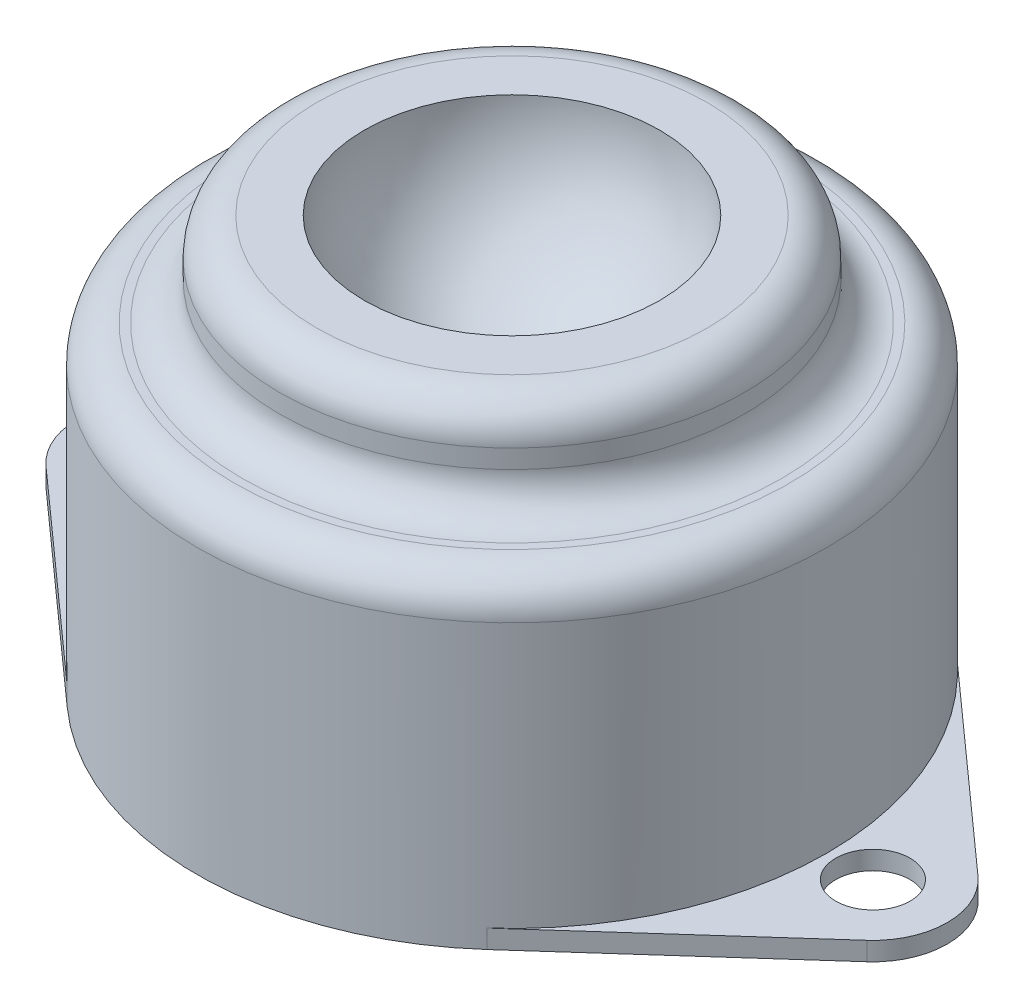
ISO-10303-21;
HEADER;
FILE_DESCRIPTION(('STEP AP214'),'2;1');
FILE_NAME('part.step','',(''),(''),'','','');
FILE_SCHEMA(('AUTOMOTIVE_DESIGN { 1 0 10303 214 1 1 1 1 }'));
ENDSEC;
DATA;
#1=APPLICATION_CONTEXT('core data for automotive mechanical design processes');
#2=APPLICATION_PROTOCOL_DEFINITION('international standard','automotive_design',2000,#1);
#3=PRODUCT_CONTEXT('',#1,'mechanical');
#4=PRODUCT('Part','Part','',(#3));
#5=PRODUCT_RELATED_PRODUCT_CATEGORY('part','',(#4));
#6=PRODUCT_DEFINITION_FORMATION('','',#4);
#7=PRODUCT_DEFINITION_CONTEXT('part definition',#1,'design');
#8=PRODUCT_DEFINITION('design','',#6,#7);
#9=PRODUCT_DEFINITION_SHAPE('','',#8);
#10=(LENGTH_UNIT() NAMED_UNIT(*) SI_UNIT(.MILLI.,.METRE.));
#11=(NAMED_UNIT(*) PLANE_ANGLE_UNIT() SI_UNIT($,.RADIAN.));
#12=(NAMED_UNIT(*) SI_UNIT($,.STERADIAN.) SOLID_ANGLE_UNIT());
#13=UNCERTAINTY_MEASURE_WITH_UNIT(LENGTH_MEASURE(1.E-05),#10,'distance_accuracy_value','');
#14=(GEOMETRIC_REPRESENTATION_CONTEXT(3) GLOBAL_UNCERTAINTY_ASSIGNED_CONTEXT((#13)) GLOBAL_UNIT_ASSIGNED_CONTEXT((#10,
#11,#12)) REPRESENTATION_CONTEXT('',''));
#15=CARTESIAN_POINT('',(0.,0.,0.));
#16=DIRECTION('',(0.,0.,1.));
#17=DIRECTION('',(1.,0.,0.));
#18=AXIS2_PLACEMENT_3D('',#15,#16,#17);
#19=CARTESIAN_POINT('',(0.,1.,0.));
#20=DIRECTION('',(0.,-1.,0.));
#21=DIRECTION('',(0.,0.,-1.));
#22=AXIS2_PLACEMENT_3D('',#19,#20,#21);
#23=CYLINDRICAL_SURFACE('',#22,16.9333333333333);
#24=CARTESIAN_POINT('',(0.,15.225,0.));
#25=DIRECTION('',(0.,1.,0.));
#26=DIRECTION('',(0.,0.,1.));
#27=AXIS2_PLACEMENT_3D('',#24,#25,#26);
#28=CIRCLE('',#27,16.9333333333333);
#29=CARTESIAN_POINT('',(0.,15.225,16.9333333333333));
#30=VERTEX_POINT('',#29);
#31=EDGE_CURVE('E189',#30,#30,#28,.F.);
#32=ORIENTED_EDGE('',*,*,#31,.T.);
#33=EDGE_LOOP('',(#32));
#34=FACE_BOUND('',#33,.T.);
#35=CARTESIAN_POINT('',(0.,0.,0.));
#36=DIRECTION('',(0.,1.,0.));
#37=DIRECTION('',(0.,0.,1.));
#38=AXIS2_PLACEMENT_3D('',#35,#36,#37);
#39=CIRCLE('',#38,16.9333333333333);
#40=CARTESIAN_POINT('',(11.2888888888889,0.,-12.6213614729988));
#41=VERTEX_POINT('',#40);
#42=CARTESIAN_POINT('',(-11.2888888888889,0.,-12.6213614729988));
#43=VERTEX_POINT('',#42);
#44=EDGE_CURVE('E95',#41,#43,#39,.T.);
#45=ORIENTED_EDGE('',*,*,#44,.T.);
#46=DIRECTION('',(0.,-1.,0.));
#47=VECTOR('',#46,1.);
#48=CARTESIAN_POINT('',(-11.2888888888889,1.,-12.6213614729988));
#49=LINE('',#48,#47);
#50=CARTESIAN_POINT('',(-11.2888888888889,1.,-12.6213614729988));
#51=VERTEX_POINT('',#50);
#52=EDGE_CURVE('E142',#51,#43,#49,.T.);
#53=ORIENTED_EDGE('',*,*,#52,.F.);
#54=CARTESIAN_POINT('',(0.,1.,0.));
#55=DIRECTION('',(0.,1.,0.));
#56=DIRECTION('',(0.,0.,1.));
#57=AXIS2_PLACEMENT_3D('',#54,#55,#56);
#58=CIRCLE('',#57,16.9333333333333);
#59=CARTESIAN_POINT('',(-11.2888888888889,1.,12.6213614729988));
#60=VERTEX_POINT('',#59);
#61=EDGE_CURVE('E62',#51,#60,#58,.T.);
#62=ORIENTED_EDGE('',*,*,#61,.T.);
#63=DIRECTION('',(0.,-1.,0.));
#64=VECTOR('',#63,1.);
#65=CARTESIAN_POINT('',(-11.2888888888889,1.,12.6213614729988));
#66=LINE('',#65,#64);
#67=CARTESIAN_POINT('',(-11.2888888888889,0.,12.6213614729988));
#68=VERTEX_POINT('',#67);
#69=EDGE_CURVE('E175',#60,#68,#66,.T.);
#70=ORIENTED_EDGE('',*,*,#69,.T.);
#71=CARTESIAN_POINT('',(11.2888888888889,0.,12.6213614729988));
#72=VERTEX_POINT('',#71);
#73=EDGE_CURVE('E157',#68,#72,#39,.T.);
#74=ORIENTED_EDGE('',*,*,#73,.T.);
#75=DIRECTION('',(0.,-1.,0.));
#76=VECTOR('',#75,1.);
#77=CARTESIAN_POINT('',(11.2888888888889,1.,12.6213614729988));
#78=LINE('',#77,#76);
#79=CARTESIAN_POINT('',(11.2888888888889,1.,12.6213614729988));
#80=VERTEX_POINT('',#79);
#81=EDGE_CURVE('E173',#80,#72,#78,.T.);
#82=ORIENTED_EDGE('',*,*,#81,.F.);
#83=CARTESIAN_POINT('',(11.2888888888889,1.,-12.6213614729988));
#84=VERTEX_POINT('',#83);
#85=EDGE_CURVE('E150',#80,#84,#58,.T.);
#86=ORIENTED_EDGE('',*,*,#85,.T.);
#87=DIRECTION('',(0.,-1.,0.));
#88=VECTOR('',#87,1.);
#89=CARTESIAN_POINT('',(11.2888888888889,1.,-12.6213614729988));
#90=LINE('',#89,#88);
#91=EDGE_CURVE('E92',#84,#41,#90,.T.);
#92=ORIENTED_EDGE('',*,*,#91,.T.);
#93=EDGE_LOOP('',(#45,#53,#62,#70,#74,#82,#86,#92));
#94=FACE_BOUND('',#93,.T.);
#95=ADVANCED_FACE('F45',(#34,#94),#23,.T.);
#96=CARTESIAN_POINT('',(0.,1.,0.));
#97=DIRECTION('',(0.,1.,0.));
#98=DIRECTION('',(0.,0.,1.));
#99=AXIS2_PLACEMENT_3D('',#96,#97,#98);
#100=PLANE('',#99);
#101=ORIENTED_EDGE('',*,*,#85,.F.);
#102=DIRECTION('',(-0.74535599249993,0.,0.666666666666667));
#103=VECTOR('',#102,1.);
#104=CARTESIAN_POINT('',(11.2888888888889,1.,12.6213614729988));
#105=LINE('',#104,#103);
#106=CARTESIAN_POINT('',(22.0666666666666,1.,2.98142396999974));
#107=VERTEX_POINT('',#106);
#108=EDGE_CURVE('E136',#107,#80,#105,.T.);
#109=ORIENTED_EDGE('',*,*,#108,.F.);
#110=CARTESIAN_POINT('',(19.4,1.,0.));
#111=DIRECTION('',(0.,1.,0.));
#112=DIRECTION('',(0.,0.,1.));
#113=AXIS2_PLACEMENT_3D('',#110,#111,#112);
#114=CIRCLE('',#113,4.);
#115=CARTESIAN_POINT('',(22.0666666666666,1.,-2.98142396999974));
#116=VERTEX_POINT('',#115);
#117=EDGE_CURVE('E119',#116,#107,#114,.F.);
#118=ORIENTED_EDGE('',*,*,#117,.F.);
#119=DIRECTION('',(0.74535599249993,0.,0.666666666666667));
#120=VECTOR('',#119,1.);
#121=CARTESIAN_POINT('',(11.2888888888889,1.,-12.6213614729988));
#122=LINE('',#121,#120);
#123=EDGE_CURVE('E134',#84,#116,#122,.T.);
#124=ORIENTED_EDGE('',*,*,#123,.F.);
#125=EDGE_LOOP('',(#101,#109,#118,#124));
#126=FACE_BOUND('',#125,.T.);
#127=CARTESIAN_POINT('',(19.4,1.,0.));
#128=DIRECTION('',(0.,1.,0.));
#129=DIRECTION('',(0.,0.,1.));
#130=AXIS2_PLACEMENT_3D('',#127,#128,#129);
#131=CIRCLE('',#130,2.);
#132=CARTESIAN_POINT('',(19.4,1.,2.));
#133=VERTEX_POINT('',#132);
#134=EDGE_CURVE('E139',#133,#133,#131,.T.);
#135=ORIENTED_EDGE('',*,*,#134,.F.);
#136=EDGE_LOOP('',(#135));
#137=FACE_BOUND('',#136,.T.);
#138=ADVANCED_FACE('F132',(#126,#137),#100,.T.);
#139=CARTESIAN_POINT('',(-11.2888888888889,1.,-12.6213614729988));
#140=DIRECTION('',(0.666666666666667,0.,0.74535599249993));
#141=DIRECTION('',(0.74535599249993,0.,-0.666666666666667));
#142=AXIS2_PLACEMENT_3D('',#139,#140,#141);
#143=PLANE('',#142);
#144=DIRECTION('',(-0.74535599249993,0.,0.666666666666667));
#145=VECTOR('',#144,1.);
#146=CARTESIAN_POINT('',(-11.2888888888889,0.,-12.6213614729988));
#147=LINE('',#146,#145);
#148=CARTESIAN_POINT('',(-22.0666666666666,0.,-2.98142396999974));
#149=VERTEX_POINT('',#148);
#150=EDGE_CURVE('E149',#43,#149,#147,.T.);
#151=ORIENTED_EDGE('',*,*,#150,.T.);
#152=DIRECTION('',(0.,-1.,0.));
#153=VECTOR('',#152,1.);
#154=CARTESIAN_POINT('',(-22.0666666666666,1.,-2.98142396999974));
#155=LINE('',#154,#153);
#156=CARTESIAN_POINT('',(-22.0666666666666,1.,-2.98142396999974));
#157=VERTEX_POINT('',#156);
#158=EDGE_CURVE('E181',#157,#149,#155,.T.);
#159=ORIENTED_EDGE('',*,*,#158,.F.);
#160=DIRECTION('',(-0.74535599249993,0.,0.666666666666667));
#161=VECTOR('',#160,1.);
#162=CARTESIAN_POINT('',(-11.2888888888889,1.,-12.6213614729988));
#163=LINE('',#162,#161);
#164=EDGE_CURVE('E269',#51,#157,#163,.T.);
#165=ORIENTED_EDGE('',*,*,#164,.F.);
#166=ORIENTED_EDGE('',*,*,#52,.T.);
#167=EDGE_LOOP('',(#151,#159,#165,#166));
#168=FACE_BOUND('',#167,.T.);
#169=ADVANCED_FACE('F221',(#168),#143,.F.);
#170=CARTESIAN_POINT('',(-19.4,1.,0.));
#171=DIRECTION('',(0.,-1.,0.));
#172=DIRECTION('',(0.,0.,-1.));
#173=AXIS2_PLACEMENT_3D('',#170,#171,#172);
#174=CYLINDRICAL_SURFACE('',#173,4.);
#175=CARTESIAN_POINT('',(-19.4,0.,0.));
#176=DIRECTION('',(0.,1.,0.));
#177=DIRECTION('',(0.,0.,1.));
#178=AXIS2_PLACEMENT_3D('',#175,#176,#177);
#179=CIRCLE('',#178,4.);
#180=CARTESIAN_POINT('',(-22.0666666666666,0.,2.98142396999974));
#181=VERTEX_POINT('',#180);
#182=EDGE_CURVE('E153',#149,#181,#179,.T.);
#183=ORIENTED_EDGE('',*,*,#182,.T.);
#184=DIRECTION('',(0.,-1.,0.));
#185=VECTOR('',#184,1.);
#186=CARTESIAN_POINT('',(-22.0666666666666,1.,2.98142396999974));
#187=LINE('',#186,#185);
#188=CARTESIAN_POINT('',(-22.0666666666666,1.,2.98142396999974));
#189=VERTEX_POINT('',#188);
#190=EDGE_CURVE('E178',#189,#181,#187,.T.);
#191=ORIENTED_EDGE('',*,*,#190,.F.);
#192=CARTESIAN_POINT('',(-19.4,1.,0.));
#193=DIRECTION('',(0.,1.,0.));
#194=DIRECTION('',(0.,0.,1.));
#195=AXIS2_PLACEMENT_3D('',#192,#193,#194);
#196=CIRCLE('',#195,4.);
#197=EDGE_CURVE('E104',#157,#189,#196,.T.);
#198=ORIENTED_EDGE('',*,*,#197,.F.);
#199=ORIENTED_EDGE('',*,*,#158,.T.);
#200=EDGE_LOOP('',(#183,#191,#198,#199));
#201=FACE_BOUND('',#200,.T.);
#202=ADVANCED_FACE('F240',(#201),#174,.T.);
#203=CARTESIAN_POINT('',(-11.2888888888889,1.,12.6213614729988));
#204=DIRECTION('',(0.666666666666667,0.,-0.74535599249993));
#205=DIRECTION('',(-0.74535599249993,0.,-0.666666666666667));
#206=AXIS2_PLACEMENT_3D('',#203,#204,#205);
#207=PLANE('',#206);
#208=DIRECTION('',(0.74535599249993,0.,0.666666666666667));
#209=VECTOR('',#208,1.);
#210=CARTESIAN_POINT('',(-11.2888888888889,0.,12.6213614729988));
#211=LINE('',#210,#209);
#212=EDGE_CURVE('E155',#181,#68,#211,.T.);
#213=ORIENTED_EDGE('',*,*,#212,.T.);
#214=ORIENTED_EDGE('',*,*,#69,.F.);
#215=DIRECTION('',(0.74535599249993,0.,0.666666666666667));
#216=VECTOR('',#215,1.);
#217=CARTESIAN_POINT('',(-11.2888888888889,1.,12.6213614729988));
#218=LINE('',#217,#216);
#219=EDGE_CURVE('E298',#189,#60,#218,.T.);
#220=ORIENTED_EDGE('',*,*,#219,.F.);
#221=ORIENTED_EDGE('',*,*,#190,.T.);
#222=EDGE_LOOP('',(#213,#214,#220,#221));
#223=FACE_BOUND('',#222,.T.);
#224=ADVANCED_FACE('F236',(#223),#207,.F.);
#225=CARTESIAN_POINT('',(11.2888888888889,1.,12.6213614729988));
#226=DIRECTION('',(0.666666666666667,0.,0.74535599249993));
#227=DIRECTION('',(0.74535599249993,0.,-0.666666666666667));
#228=AXIS2_PLACEMENT_3D('',#225,#226,#227);
#229=PLANE('',#228);
#230=DIRECTION('',(-0.74535599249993,0.,0.666666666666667));
#231=VECTOR('',#230,1.);
#232=CARTESIAN_POINT('',(11.2888888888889,0.,12.6213614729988));
#233=LINE('',#232,#231);
#234=CARTESIAN_POINT('',(22.0666666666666,0.,2.98142396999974));
#235=VERTEX_POINT('',#234);
#236=EDGE_CURVE('E160',#235,#72,#233,.T.);
#237=ORIENTED_EDGE('',*,*,#236,.F.);
#238=DIRECTION('',(0.,-1.,0.));
#239=VECTOR('',#238,1.);
#240=CARTESIAN_POINT('',(22.0666666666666,1.,2.98142396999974));
#241=LINE('',#240,#239);
#242=EDGE_CURVE('E126',#107,#235,#241,.T.);
#243=ORIENTED_EDGE('',*,*,#242,.F.);
#244=ORIENTED_EDGE('',*,*,#108,.T.);
#245=ORIENTED_EDGE('',*,*,#81,.T.);
#246=EDGE_LOOP('',(#237,#243,#244,#245));
#247=FACE_BOUND('',#246,.T.);
#248=ADVANCED_FACE('F233',(#247),#229,.T.);
#249=CARTESIAN_POINT('',(19.4,1.,0.));
#250=DIRECTION('',(0.,-1.,0.));
#251=DIRECTION('',(0.,0.,-1.));
#252=AXIS2_PLACEMENT_3D('',#249,#250,#251);
#253=CYLINDRICAL_SURFACE('',#252,4.);
#254=CARTESIAN_POINT('',(19.4,0.,0.));
#255=DIRECTION('',(0.,1.,0.));
#256=DIRECTION('',(0.,0.,1.));
#257=AXIS2_PLACEMENT_3D('',#254,#255,#256);
#258=CIRCLE('',#257,4.);
#259=CARTESIAN_POINT('',(22.0666666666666,0.,-2.98142396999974));
#260=VERTEX_POINT('',#259);
#261=EDGE_CURVE('E121',#260,#235,#258,.F.);
#262=ORIENTED_EDGE('',*,*,#261,.F.);
#263=DIRECTION('',(0.,-1.,0.));
#264=VECTOR('',#263,1.);
#265=CARTESIAN_POINT('',(22.0666666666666,1.,-2.98142396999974));
#266=LINE('',#265,#264);
#267=EDGE_CURVE('E116',#116,#260,#266,.T.);
#268=ORIENTED_EDGE('',*,*,#267,.F.);
#269=ORIENTED_EDGE('',*,*,#117,.T.);
#270=ORIENTED_EDGE('',*,*,#242,.T.);
#271=EDGE_LOOP('',(#262,#268,#269,#270));
#272=FACE_BOUND('',#271,.T.);
#273=ADVANCED_FACE('F118',(#272),#253,.T.);
#274=CARTESIAN_POINT('',(11.2888888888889,1.,-12.6213614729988));
#275=DIRECTION('',(0.666666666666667,0.,-0.74535599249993));
#276=DIRECTION('',(-0.74535599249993,0.,-0.666666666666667));
#277=AXIS2_PLACEMENT_3D('',#274,#275,#276);
#278=PLANE('',#277);
#279=DIRECTION('',(0.74535599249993,0.,0.666666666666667));
#280=VECTOR('',#279,1.);
#281=CARTESIAN_POINT('',(11.2888888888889,0.,-12.6213614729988));
#282=LINE('',#281,#280);
#283=EDGE_CURVE('E164',#41,#260,#282,.T.);
#284=ORIENTED_EDGE('',*,*,#283,.F.);
#285=ORIENTED_EDGE('',*,*,#91,.F.);
#286=ORIENTED_EDGE('',*,*,#123,.T.);
#287=ORIENTED_EDGE('',*,*,#267,.T.);
#288=EDGE_LOOP('',(#284,#285,#286,#287));
#289=FACE_BOUND('',#288,.T.);
#290=ADVANCED_FACE('F138',(#289),#278,.T.);
#291=CARTESIAN_POINT('',(-19.4,1.,0.));
#292=DIRECTION('',(0.,-1.,0.));
#293=DIRECTION('',(0.,0.,-1.));
#294=AXIS2_PLACEMENT_3D('',#291,#292,#293);
#295=CYLINDRICAL_SURFACE('',#294,2.);
#296=CARTESIAN_POINT('',(-19.4,1.,0.));
#297=DIRECTION('',(0.,1.,0.));
#298=DIRECTION('',(0.,0.,1.));
#299=AXIS2_PLACEMENT_3D('',#296,#297,#298);
#300=CIRCLE('',#299,2.);
#301=CARTESIAN_POINT('',(-19.4,1.,2.));
#302=VERTEX_POINT('',#301);
#303=EDGE_CURVE('E169',#302,#302,#300,.T.);
#304=ORIENTED_EDGE('',*,*,#303,.T.);
#305=EDGE_LOOP('',(#304));
#306=FACE_BOUND('',#305,.T.);
#307=CARTESIAN_POINT('',(-19.4,0.,0.));
#308=DIRECTION('',(0.,1.,0.));
#309=DIRECTION('',(0.,0.,1.));
#310=AXIS2_PLACEMENT_3D('',#307,#308,#309);
#311=CIRCLE('',#310,2.);
#312=CARTESIAN_POINT('',(-19.4,0.,2.));
#313=VERTEX_POINT('',#312);
#314=EDGE_CURVE('E146',#313,#313,#311,.T.);
#315=ORIENTED_EDGE('',*,*,#314,.F.);
#316=EDGE_LOOP('',(#315));
#317=FACE_BOUND('',#316,.T.);
#318=ADVANCED_FACE('F230',(#306,#317),#295,.F.);
#319=CARTESIAN_POINT('',(19.4,1.,0.));
#320=DIRECTION('',(0.,-1.,0.));
#321=DIRECTION('',(0.,0.,-1.));
#322=AXIS2_PLACEMENT_3D('',#319,#320,#321);
#323=CYLINDRICAL_SURFACE('',#322,2.);
#324=ORIENTED_EDGE('',*,*,#134,.T.);
#325=EDGE_LOOP('',(#324));
#326=FACE_BOUND('',#325,.T.);
#327=CARTESIAN_POINT('',(19.4,0.,0.));
#328=DIRECTION('',(0.,1.,0.));
#329=DIRECTION('',(0.,0.,1.));
#330=AXIS2_PLACEMENT_3D('',#327,#328,#329);
#331=CIRCLE('',#330,2.);
#332=CARTESIAN_POINT('',(19.4,0.,2.));
#333=VERTEX_POINT('',#332);
#334=EDGE_CURVE('E166',#333,#333,#331,.T.);
#335=ORIENTED_EDGE('',*,*,#334,.F.);
#336=EDGE_LOOP('',(#335));
#337=FACE_BOUND('',#336,.T.);
#338=ADVANCED_FACE('F226',(#326,#337),#323,.F.);
#339=ORIENTED_EDGE('',*,*,#61,.F.);
#340=ORIENTED_EDGE('',*,*,#164,.T.);
#341=ORIENTED_EDGE('',*,*,#197,.T.);
#342=ORIENTED_EDGE('',*,*,#219,.T.);
#343=EDGE_LOOP('',(#339,#340,#341,#342));
#344=FACE_BOUND('',#343,.T.);
#345=ORIENTED_EDGE('',*,*,#303,.F.);
#346=EDGE_LOOP('',(#345));
#347=FACE_BOUND('',#346,.T.);
#348=ADVANCED_FACE('F223',(#344,#347),#100,.T.);
#349=CARTESIAN_POINT('',(0.,0.,0.));
#350=DIRECTION('',(0.,1.,0.));
#351=DIRECTION('',(0.,0.,1.));
#352=AXIS2_PLACEMENT_3D('',#349,#350,#351);
#353=PLANE('',#352);
#354=ORIENTED_EDGE('',*,*,#314,.T.);
#355=EDGE_LOOP('',(#354));
#356=FACE_BOUND('',#355,.T.);
#357=ORIENTED_EDGE('',*,*,#150,.F.);
#358=ORIENTED_EDGE('',*,*,#44,.F.);
#359=ORIENTED_EDGE('',*,*,#283,.T.);
#360=ORIENTED_EDGE('',*,*,#261,.T.);
#361=ORIENTED_EDGE('',*,*,#236,.T.);
#362=ORIENTED_EDGE('',*,*,#73,.F.);
#363=ORIENTED_EDGE('',*,*,#212,.F.);
#364=ORIENTED_EDGE('',*,*,#182,.F.);
#365=EDGE_LOOP('',(#357,#358,#359,#360,#361,#362,#363,#364));
#366=FACE_BOUND('',#365,.T.);
#367=ORIENTED_EDGE('',*,*,#334,.T.);
#368=EDGE_LOOP('',(#367));
#369=FACE_BOUND('',#368,.T.);
#370=ADVANCED_FACE('F258',(#356,#366,#369),#353,.F.);
#371=CARTESIAN_POINT('',(0.,17.225,0.));
#372=DIRECTION('',(0.,1.,0.));
#373=DIRECTION('',(0.,0.,1.));
#374=AXIS2_PLACEMENT_3D('',#371,#372,#373);
#375=PLANE('',#374);
#376=CARTESIAN_POINT('',(0.,17.225,0.));
#377=DIRECTION('',(0.,1.,0.));
#378=DIRECTION('',(0.,0.,1.));
#379=AXIS2_PLACEMENT_3D('',#376,#377,#378);
#380=CIRCLE('',#379,14.9333333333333);
#381=CARTESIAN_POINT('',(0.,17.225,14.9333333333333));
#382=VERTEX_POINT('',#381);
#383=EDGE_CURVE('E186',#382,#382,#380,.T.);
#384=ORIENTED_EDGE('',*,*,#383,.T.);
#385=EDGE_LOOP('',(#384));
#386=FACE_BOUND('',#385,.T.);
#387=CARTESIAN_POINT('',(0.,17.225,0.));
#388=DIRECTION('',(0.,1.,0.));
#389=DIRECTION('',(0.,0.,1.));
#390=AXIS2_PLACEMENT_3D('',#387,#388,#389);
#391=CIRCLE('',#390,14.5);
#392=CARTESIAN_POINT('',(0.,17.225,14.5));
#393=VERTEX_POINT('',#392);
#394=EDGE_CURVE('E183',#393,#393,#391,.F.);
#395=ORIENTED_EDGE('',*,*,#394,.T.);
#396=EDGE_LOOP('',(#395));
#397=FACE_BOUND('',#396,.T.);
#398=ADVANCED_FACE('F261',(#386,#397),#375,.T.);
#399=CARTESIAN_POINT('',(0.,17.225,0.));
#400=DIRECTION('',(0.,1.,0.));
#401=DIRECTION('',(0.,0.,1.));
#402=AXIS2_PLACEMENT_3D('',#399,#400,#401);
#403=CYLINDRICAL_SURFACE('',#402,12.5);
#404=CARTESIAN_POINT('',(0.,19.225,0.));
#405=DIRECTION('',(0.,1.,0.));
#406=DIRECTION('',(0.,0.,1.));
#407=AXIS2_PLACEMENT_3D('',#404,#405,#406);
#408=CIRCLE('',#407,12.5);
#409=CARTESIAN_POINT('',(0.,19.225,12.5));
#410=VERTEX_POINT('',#409);
#411=EDGE_CURVE('E54',#410,#410,#408,.T.);
#412=ORIENTED_EDGE('',*,*,#411,.T.);
#413=EDGE_LOOP('',(#412));
#414=FACE_BOUND('',#413,.T.);
#415=CARTESIAN_POINT('',(0.,20.225,0.));
#416=DIRECTION('',(0.,1.,0.));
#417=DIRECTION('',(0.,0.,1.));
#418=AXIS2_PLACEMENT_3D('',#415,#416,#417);
#419=CIRCLE('',#418,12.5);
#420=CARTESIAN_POINT('',(0.,20.225,12.5));
#421=VERTEX_POINT('',#420);
#422=EDGE_CURVE('E192',#421,#421,#419,.F.);
#423=ORIENTED_EDGE('',*,*,#422,.T.);
#424=EDGE_LOOP('',(#423));
#425=FACE_BOUND('',#424,.T.);
#426=ADVANCED_FACE('F197',(#414,#425),#403,.T.);
#427=CARTESIAN_POINT('',(0.,22.225,0.));
#428=DIRECTION('',(0.,0.,-1.));
#429=DIRECTION('',(-1.,0.,0.));
#430=AXIS2_PLACEMENT_3D('',#427,#428,#429);
#431=SPHERICAL_SURFACE('',#430,7.9375);
#432=CARTESIAN_POINT('',(0.,22.225,0.));
#433=DIRECTION('',(0.,-1.,0.));
#434=DIRECTION('',(0.,0.,1.));
#435=AXIS2_PLACEMENT_3D('',#432,#433,#434);
#436=SPHERICAL_SURFACE('',#435,7.9375);
#437=CARTESIAN_POINT('',(0.,22.225,0.));
#438=DIRECTION('',(0.,-1.,0.));
#439=DIRECTION('',(0.,0.,1.));
#440=AXIS2_PLACEMENT_3D('',#437,#438,#439);
#441=CIRCLE('',#440,7.9375);
#442=CARTESIAN_POINT('',(0.,22.225,7.9375));
#443=VERTEX_POINT('',#442);
#444=EDGE_CURVE('E275',#443,#443,#441,.T.);
#445=ORIENTED_EDGE('',*,*,#444,.F.);
#446=EDGE_LOOP('',(#445));
#447=FACE_BOUND('',#446,.T.);
#448=ADVANCED_FACE('F281',(#447),#436,.F.);
#449=CARTESIAN_POINT('',(0.,22.225,0.));
#450=DIRECTION('',(0.,1.,0.));
#451=DIRECTION('',(0.,0.,1.));
#452=AXIS2_PLACEMENT_3D('',#449,#450,#451);
#453=PLANE('',#452);
#454=CARTESIAN_POINT('',(0.,22.225,0.));
#455=DIRECTION('',(0.,1.,0.));
#456=DIRECTION('',(0.,0.,1.));
#457=AXIS2_PLACEMENT_3D('',#454,#455,#456);
#458=CIRCLE('',#457,10.5);
#459=CARTESIAN_POINT('',(0.,22.225,10.5));
#460=VERTEX_POINT('',#459);
#461=EDGE_CURVE('E11',#460,#460,#458,.T.);
#462=ORIENTED_EDGE('',*,*,#461,.T.);
#463=EDGE_LOOP('',(#462));
#464=FACE_BOUND('',#463,.T.);
#465=ORIENTED_EDGE('',*,*,#444,.T.);
#466=EDGE_LOOP('',(#465));
#467=FACE_BOUND('',#466,.T.);
#468=ADVANCED_FACE('F209',(#464,#467),#453,.T.);
#469=CARTESIAN_POINT('',(0.,15.225,0.));
#470=DIRECTION('',(0.,1.,0.));
#471=DIRECTION('',(0.,0.,1.));
#472=AXIS2_PLACEMENT_3D('',#469,#470,#471);
#473=TOROIDAL_SURFACE('',#472,14.9333333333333,2.);
#474=ORIENTED_EDGE('',*,*,#31,.F.);
#475=EDGE_LOOP('',(#474));
#476=FACE_BOUND('',#475,.T.);
#477=ORIENTED_EDGE('',*,*,#383,.F.);
#478=EDGE_LOOP('',(#477));
#479=FACE_BOUND('',#478,.T.);
#480=ADVANCED_FACE('F202',(#476,#479),#473,.T.);
#481=CARTESIAN_POINT('',(0.,19.225,0.));
#482=DIRECTION('',(0.,1.,0.));
#483=DIRECTION('',(0.,0.,1.));
#484=AXIS2_PLACEMENT_3D('',#481,#482,#483);
#485=TOROIDAL_SURFACE('',#484,14.5,2.);
#486=ORIENTED_EDGE('',*,*,#394,.F.);
#487=EDGE_LOOP('',(#486));
#488=FACE_BOUND('',#487,.T.);
#489=ORIENTED_EDGE('',*,*,#411,.F.);
#490=EDGE_LOOP('',(#489));
#491=FACE_BOUND('',#490,.T.);
#492=ADVANCED_FACE('F200',(#488,#491),#485,.F.);
#493=CARTESIAN_POINT('',(0.,20.225,0.));
#494=DIRECTION('',(0.,1.,0.));
#495=DIRECTION('',(0.,0.,1.));
#496=AXIS2_PLACEMENT_3D('',#493,#494,#495);
#497=TOROIDAL_SURFACE('',#496,10.5,2.);
#498=ORIENTED_EDGE('',*,*,#422,.F.);
#499=EDGE_LOOP('',(#498));
#500=FACE_BOUND('',#499,.T.);
#501=ORIENTED_EDGE('',*,*,#461,.F.);
#502=EDGE_LOOP('',(#501));
#503=FACE_BOUND('',#502,.T.);
#504=ADVANCED_FACE('F47',(#500,#503),#497,.T.);
#505=CLOSED_SHELL('',(#95,#138,#169,#202,#224,#248,#273,#290,#318,#338,#348,#370,#398,#426,#448,
#468,#480,#492,#504));
#506=MANIFOLD_SOLID_BREP('B2',#505);
#507=ADVANCED_BREP_SHAPE_REPRESENTATION('',(#18,#506),#14);
#508=SHAPE_DEFINITION_REPRESENTATION(#9,#507);
ENDSEC;
END-ISO-10303-21;
